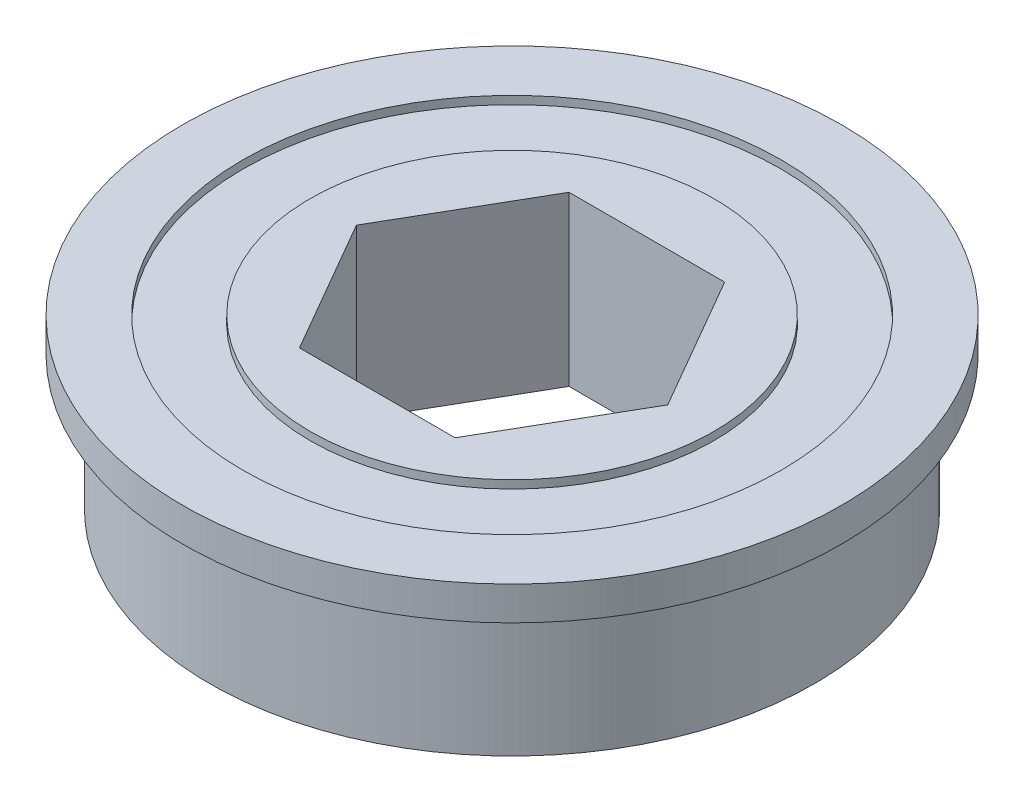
ISO-10303-21;
HEADER;
FILE_DESCRIPTION(('STEP AP214'),'2;1');
FILE_NAME('part.step','',(''),(''),'','','');
FILE_SCHEMA(('AUTOMOTIVE_DESIGN { 1 0 10303 214 1 1 1 1 }'));
ENDSEC;
DATA;
#1=APPLICATION_CONTEXT('core data for automotive mechanical design processes');
#2=APPLICATION_PROTOCOL_DEFINITION('international standard','automotive_design',2000,#1);
#3=PRODUCT_CONTEXT('',#1,'mechanical');
#4=PRODUCT('Part','Part','',(#3));
#5=PRODUCT_RELATED_PRODUCT_CATEGORY('part','',(#4));
#6=PRODUCT_DEFINITION_FORMATION('','',#4);
#7=PRODUCT_DEFINITION_CONTEXT('part definition',#1,'design');
#8=PRODUCT_DEFINITION('design','',#6,#7);
#9=PRODUCT_DEFINITION_SHAPE('','',#8);
#10=(LENGTH_UNIT() NAMED_UNIT(*) SI_UNIT(.MILLI.,.METRE.));
#11=(NAMED_UNIT(*) PLANE_ANGLE_UNIT() SI_UNIT($,.RADIAN.));
#12=(NAMED_UNIT(*) SI_UNIT($,.STERADIAN.) SOLID_ANGLE_UNIT());
#13=UNCERTAINTY_MEASURE_WITH_UNIT(LENGTH_MEASURE(1.E-05),#10,'distance_accuracy_value','');
#14=(GEOMETRIC_REPRESENTATION_CONTEXT(3) GLOBAL_UNCERTAINTY_ASSIGNED_CONTEXT((#13)) GLOBAL_UNIT_ASSIGNED_CONTEXT((#10,
#11,#12)) REPRESENTATION_CONTEXT('',''));
#15=CARTESIAN_POINT('',(0.,0.,0.));
#16=DIRECTION('',(0.,0.,1.));
#17=DIRECTION('',(1.,0.,0.));
#18=AXIS2_PLACEMENT_3D('',#15,#16,#17);
#19=CARTESIAN_POINT('',(0.,-7.5565,0.));
#20=DIRECTION('',(0.,-1.,0.));
#21=DIRECTION('',(0.,0.,-1.));
#22=AXIS2_PLACEMENT_3D('',#19,#20,#21);
#23=PLANE('',#22);
#24=CARTESIAN_POINT('',(0.,-7.5565,0.));
#25=DIRECTION('',(0.,1.,0.));
#26=DIRECTION('',(0.,0.,1.));
#27=AXIS2_PLACEMENT_3D('',#24,#25,#26);
#28=CIRCLE('',#27,12.7);
#29=CARTESIAN_POINT('',(0.,-7.5565,12.7));
#30=VERTEX_POINT('',#29);
#31=EDGE_CURVE('E11',#30,#30,#28,.T.);
#32=ORIENTED_EDGE('',*,*,#31,.F.);
#33=EDGE_LOOP('',(#32));
#34=FACE_BOUND('',#33,.T.);
#35=CARTESIAN_POINT('',(0.,-7.5565,0.));
#36=DIRECTION('',(0.,1.,0.));
#37=DIRECTION('',(0.,0.,1.));
#38=AXIS2_PLACEMENT_3D('',#35,#36,#37);
#39=CIRCLE('',#38,9.525);
#40=CARTESIAN_POINT('',(0.,-7.5565,9.525));
#41=VERTEX_POINT('',#40);
#42=EDGE_CURVE('E26',#41,#41,#39,.T.);
#43=ORIENTED_EDGE('',*,*,#42,.T.);
#44=EDGE_LOOP('',(#43));
#45=FACE_BOUND('',#44,.T.);
#46=ADVANCED_FACE('F17',(#34,#45),#23,.T.);
#47=CARTESIAN_POINT('',(0.,-7.5565,0.));
#48=DIRECTION('',(0.,-1.,0.));
#49=DIRECTION('',(0.,0.,-1.));
#50=AXIS2_PLACEMENT_3D('',#47,#48,#49);
#51=CYLINDRICAL_SURFACE('',#50,12.7);
#52=CARTESIAN_POINT('',(0.,-7.9375,0.));
#53=DIRECTION('',(0.,1.,0.));
#54=DIRECTION('',(0.,0.,1.));
#55=AXIS2_PLACEMENT_3D('',#52,#53,#54);
#56=CIRCLE('',#55,12.7);
#57=CARTESIAN_POINT('',(0.,-7.9375,12.7));
#58=VERTEX_POINT('',#57);
#59=EDGE_CURVE('E184',#58,#58,#56,.T.);
#60=ORIENTED_EDGE('',*,*,#59,.F.);
#61=EDGE_LOOP('',(#60));
#62=FACE_BOUND('',#61,.T.);
#63=ORIENTED_EDGE('',*,*,#31,.T.);
#64=EDGE_LOOP('',(#63));
#65=FACE_BOUND('',#64,.T.);
#66=ADVANCED_FACE('F19',(#62,#65),#51,.F.);
#67=CARTESIAN_POINT('',(0.,-7.5565,0.));
#68=DIRECTION('',(0.,-1.,0.));
#69=DIRECTION('',(0.,0.,-1.));
#70=AXIS2_PLACEMENT_3D('',#67,#68,#69);
#71=CYLINDRICAL_SURFACE('',#70,9.525);
#72=CARTESIAN_POINT('',(0.,-7.9375,0.));
#73=DIRECTION('',(0.,1.,0.));
#74=DIRECTION('',(0.,0.,1.));
#75=AXIS2_PLACEMENT_3D('',#72,#73,#74);
#76=CIRCLE('',#75,9.525);
#77=CARTESIAN_POINT('',(0.,-7.9375,9.525));
#78=VERTEX_POINT('',#77);
#79=EDGE_CURVE('E164',#78,#78,#76,.T.);
#80=ORIENTED_EDGE('',*,*,#79,.T.);
#81=EDGE_LOOP('',(#80));
#82=FACE_BOUND('',#81,.T.);
#83=ORIENTED_EDGE('',*,*,#42,.F.);
#84=EDGE_LOOP('',(#83));
#85=FACE_BOUND('',#84,.T.);
#86=ADVANCED_FACE('F278',(#82,#85),#71,.T.);
#87=CARTESIAN_POINT('',(0.,-0.381,0.));
#88=DIRECTION('',(0.,1.,0.));
#89=DIRECTION('',(1.,0.,0.));
#90=AXIS2_PLACEMENT_3D('',#87,#88,#89);
#91=PLANE('',#90);
#92=CARTESIAN_POINT('',(0.,-0.381,0.));
#93=DIRECTION('',(0.,1.,0.));
#94=DIRECTION('',(0.,0.,1.));
#95=AXIS2_PLACEMENT_3D('',#92,#93,#94);
#96=CIRCLE('',#95,12.7);
#97=CARTESIAN_POINT('',(0.,-0.381,12.7));
#98=VERTEX_POINT('',#97);
#99=EDGE_CURVE('E246',#98,#98,#96,.T.);
#100=ORIENTED_EDGE('',*,*,#99,.T.);
#101=EDGE_LOOP('',(#100));
#102=FACE_BOUND('',#101,.T.);
#103=CARTESIAN_POINT('',(0.,-0.381,0.));
#104=DIRECTION('',(0.,1.,0.));
#105=DIRECTION('',(0.,0.,1.));
#106=AXIS2_PLACEMENT_3D('',#103,#104,#105);
#107=CIRCLE('',#106,9.525);
#108=CARTESIAN_POINT('',(0.,-0.381,9.525));
#109=VERTEX_POINT('',#108);
#110=EDGE_CURVE('E213',#109,#109,#107,.T.);
#111=ORIENTED_EDGE('',*,*,#110,.F.);
#112=EDGE_LOOP('',(#111));
#113=FACE_BOUND('',#112,.T.);
#114=ADVANCED_FACE('F282',(#102,#113),#91,.T.);
#115=CARTESIAN_POINT('',(0.,-0.381,0.));
#116=DIRECTION('',(0.,1.,0.));
#117=DIRECTION('',(0.,0.,1.));
#118=AXIS2_PLACEMENT_3D('',#115,#116,#117);
#119=CYLINDRICAL_SURFACE('',#118,12.7);
#120=CARTESIAN_POINT('',(0.,0.,0.));
#121=DIRECTION('',(0.,1.,0.));
#122=DIRECTION('',(0.,0.,1.));
#123=AXIS2_PLACEMENT_3D('',#120,#121,#122);
#124=CIRCLE('',#123,12.7);
#125=CARTESIAN_POINT('',(0.,0.,12.7));
#126=VERTEX_POINT('',#125);
#127=EDGE_CURVE('E229',#126,#126,#124,.T.);
#128=ORIENTED_EDGE('',*,*,#127,.T.);
#129=EDGE_LOOP('',(#128));
#130=FACE_BOUND('',#129,.T.);
#131=ORIENTED_EDGE('',*,*,#99,.F.);
#132=EDGE_LOOP('',(#131));
#133=FACE_BOUND('',#132,.T.);
#134=ADVANCED_FACE('F396',(#130,#133),#119,.F.);
#135=CARTESIAN_POINT('',(0.,-0.381,0.));
#136=DIRECTION('',(0.,1.,0.));
#137=DIRECTION('',(0.,0.,1.));
#138=AXIS2_PLACEMENT_3D('',#135,#136,#137);
#139=CYLINDRICAL_SURFACE('',#138,9.525);
#140=CARTESIAN_POINT('',(0.,0.,0.));
#141=DIRECTION('',(0.,1.,0.));
#142=DIRECTION('',(0.,0.,1.));
#143=AXIS2_PLACEMENT_3D('',#140,#141,#142);
#144=CIRCLE('',#143,9.525);
#145=CARTESIAN_POINT('',(0.,0.,9.525));
#146=VERTEX_POINT('',#145);
#147=EDGE_CURVE('E188',#146,#146,#144,.T.);
#148=ORIENTED_EDGE('',*,*,#147,.F.);
#149=EDGE_LOOP('',(#148));
#150=FACE_BOUND('',#149,.T.);
#151=ORIENTED_EDGE('',*,*,#110,.T.);
#152=EDGE_LOOP('',(#151));
#153=FACE_BOUND('',#152,.T.);
#154=ADVANCED_FACE('F367',(#150,#153),#139,.T.);
#155=CARTESIAN_POINT('',(0.,-1.8415,0.));
#156=DIRECTION('',(0.,-1.,0.));
#157=DIRECTION('',(0.,0.,-1.));
#158=AXIS2_PLACEMENT_3D('',#155,#156,#157);
#159=TOROIDAL_SURFACE('',#158,14.2748,0.254);
#160=CARTESIAN_POINT('',(0.,-1.9685,0.));
#161=DIRECTION('',(0.,-1.,0.));
#162=DIRECTION('',(0.,0.,-1.));
#163=AXIS2_PLACEMENT_3D('',#160,#161,#162);
#164=CIRCLE('',#163,14.0548295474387);
#165=CARTESIAN_POINT('',(0.,-1.9685,-14.0548295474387));
#166=VERTEX_POINT('',#165);
#167=EDGE_CURVE('E182',#166,#166,#164,.T.);
#168=ORIENTED_EDGE('',*,*,#167,.F.);
#169=EDGE_LOOP('',(#168));
#170=FACE_BOUND('',#169,.T.);
#171=CARTESIAN_POINT('',(0.,-1.5875,0.));
#172=DIRECTION('',(0.,-1.,0.));
#173=DIRECTION('',(0.,0.,-1.));
#174=AXIS2_PLACEMENT_3D('',#171,#172,#173);
#175=CIRCLE('',#174,14.2748);
#176=CARTESIAN_POINT('',(0.,-1.5875,-14.2748));
#177=VERTEX_POINT('',#176);
#178=EDGE_CURVE('E204',#177,#177,#175,.T.);
#179=ORIENTED_EDGE('',*,*,#178,.T.);
#180=EDGE_LOOP('',(#179));
#181=FACE_BOUND('',#180,.T.);
#182=ADVANCED_FACE('F362',(#170,#181),#159,.F.);
#183=CARTESIAN_POINT('',(0.,-1.9685,0.));
#184=DIRECTION('',(0.,-1.,0.));
#185=DIRECTION('',(0.,0.,-1.));
#186=AXIS2_PLACEMENT_3D('',#183,#184,#185);
#187=CONICAL_SURFACE('',#186,14.0548295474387,0.523598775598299);
#188=ORIENTED_EDGE('',*,*,#167,.T.);
#189=EDGE_LOOP('',(#188));
#190=FACE_BOUND('',#189,.T.);
#191=CARTESIAN_POINT('',(0.,-2.3495,0.));
#192=DIRECTION('',(0.,-1.,0.));
#193=DIRECTION('',(0.,0.,-1.));
#194=AXIS2_PLACEMENT_3D('',#191,#192,#193);
#195=CIRCLE('',#194,14.2748);
#196=CARTESIAN_POINT('',(0.,-2.3495,-14.2748));
#197=VERTEX_POINT('',#196);
#198=EDGE_CURVE('E235',#197,#197,#195,.T.);
#199=ORIENTED_EDGE('',*,*,#198,.F.);
#200=EDGE_LOOP('',(#199));
#201=FACE_BOUND('',#200,.T.);
#202=ADVANCED_FACE('F366',(#190,#201),#187,.T.);
#203=CARTESIAN_POINT('',(-5.51025983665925,-44.7234247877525,-3.18135));
#204=DIRECTION('',(0.866025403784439,0.,0.5));
#205=DIRECTION('',(0.,-1.,0.));
#206=AXIS2_PLACEMENT_3D('',#203,#204,#205);
#207=PLANE('',#206);
#208=DIRECTION('',(0.,1.,0.));
#209=VECTOR('',#208,1.);
#210=CARTESIAN_POINT('',(-3.67350655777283,-44.7234247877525,-6.3627));
#211=LINE('',#210,#209);
#212=CARTESIAN_POINT('',(-3.67350655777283,-7.9375,-6.3627));
#213=VERTEX_POINT('',#212);
#214=CARTESIAN_POINT('',(-3.67350655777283,0.,-6.3627));
#215=VERTEX_POINT('',#214);
#216=EDGE_CURVE('E153',#213,#215,#211,.T.);
#217=ORIENTED_EDGE('',*,*,#216,.T.);
#218=DIRECTION('',(0.5,0.,-0.866025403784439));
#219=VECTOR('',#218,1.);
#220=CARTESIAN_POINT('',(-5.51025983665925,0.,-3.18135));
#221=LINE('',#220,#219);
#222=CARTESIAN_POINT('',(-7.34701311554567,0.,0.));
#223=VERTEX_POINT('',#222);
#224=EDGE_CURVE('E221',#223,#215,#221,.T.);
#225=ORIENTED_EDGE('',*,*,#224,.F.);
#226=DIRECTION('',(0.,1.,0.));
#227=VECTOR('',#226,1.);
#228=CARTESIAN_POINT('',(-7.34701311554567,-44.7234247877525,0.));
#229=LINE('',#228,#227);
#230=CARTESIAN_POINT('',(-7.34701311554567,-7.9375,0.));
#231=VERTEX_POINT('',#230);
#232=EDGE_CURVE('E179',#231,#223,#229,.T.);
#233=ORIENTED_EDGE('',*,*,#232,.F.);
#234=DIRECTION('',(-0.5,0.,0.866025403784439));
#235=VECTOR('',#234,1.);
#236=CARTESIAN_POINT('',(-5.51025983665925,-7.9375,-3.18135));
#237=LINE('',#236,#235);
#238=EDGE_CURVE('E175',#213,#231,#237,.T.);
#239=ORIENTED_EDGE('',*,*,#238,.F.);
#240=EDGE_LOOP('',(#217,#225,#233,#239));
#241=FACE_BOUND('',#240,.T.);
#242=ADVANCED_FACE('F338',(#241),#207,.T.);
#243=CARTESIAN_POINT('',(-5.51025983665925,-44.7234247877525,3.18135));
#244=DIRECTION('',(0.866025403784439,0.,-0.5));
#245=DIRECTION('',(0.,-1.,0.));
#246=AXIS2_PLACEMENT_3D('',#243,#244,#245);
#247=PLANE('',#246);
#248=ORIENTED_EDGE('',*,*,#232,.T.);
#249=DIRECTION('',(-0.5,0.,-0.866025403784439));
#250=VECTOR('',#249,1.);
#251=CARTESIAN_POINT('',(-5.51025983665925,0.,3.18135));
#252=LINE('',#251,#250);
#253=CARTESIAN_POINT('',(-3.67350655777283,0.,6.3627));
#254=VERTEX_POINT('',#253);
#255=EDGE_CURVE('E217',#254,#223,#252,.T.);
#256=ORIENTED_EDGE('',*,*,#255,.F.);
#257=DIRECTION('',(0.,1.,0.));
#258=VECTOR('',#257,1.);
#259=CARTESIAN_POINT('',(-3.67350655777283,-44.7234247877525,6.3627));
#260=LINE('',#259,#258);
#261=CARTESIAN_POINT('',(-3.67350655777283,-7.9375,6.3627));
#262=VERTEX_POINT('',#261);
#263=EDGE_CURVE('E183',#262,#254,#260,.T.);
#264=ORIENTED_EDGE('',*,*,#263,.F.);
#265=DIRECTION('',(0.5,0.,0.866025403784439));
#266=VECTOR('',#265,1.);
#267=CARTESIAN_POINT('',(-5.51025983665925,-7.9375,3.18135));
#268=LINE('',#267,#266);
#269=EDGE_CURVE('E192',#231,#262,#268,.T.);
#270=ORIENTED_EDGE('',*,*,#269,.F.);
#271=EDGE_LOOP('',(#248,#256,#264,#270));
#272=FACE_BOUND('',#271,.T.);
#273=ADVANCED_FACE('F333',(#272),#247,.T.);
#274=CARTESIAN_POINT('',(0.,-44.7234247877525,6.3627));
#275=DIRECTION('',(0.,0.,-1.));
#276=DIRECTION('',(-1.,0.,0.));
#277=AXIS2_PLACEMENT_3D('',#274,#275,#276);
#278=PLANE('',#277);
#279=ORIENTED_EDGE('',*,*,#263,.T.);
#280=DIRECTION('',(-1.,0.,0.));
#281=VECTOR('',#280,1.);
#282=CARTESIAN_POINT('',(0.,0.,6.3627));
#283=LINE('',#282,#281);
#284=CARTESIAN_POINT('',(3.67350655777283,0.,6.3627));
#285=VERTEX_POINT('',#284);
#286=EDGE_CURVE('E210',#285,#254,#283,.T.);
#287=ORIENTED_EDGE('',*,*,#286,.F.);
#288=DIRECTION('',(0.,1.,0.));
#289=VECTOR('',#288,1.);
#290=CARTESIAN_POINT('',(3.67350655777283,-44.7234247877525,6.3627));
#291=LINE('',#290,#289);
#292=CARTESIAN_POINT('',(3.67350655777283,-7.9375,6.3627));
#293=VERTEX_POINT('',#292);
#294=EDGE_CURVE('E152',#293,#285,#291,.T.);
#295=ORIENTED_EDGE('',*,*,#294,.F.);
#296=DIRECTION('',(1.,0.,0.));
#297=VECTOR('',#296,1.);
#298=CARTESIAN_POINT('',(0.,-7.9375,6.3627));
#299=LINE('',#298,#297);
#300=EDGE_CURVE('E162',#262,#293,#299,.T.);
#301=ORIENTED_EDGE('',*,*,#300,.F.);
#302=EDGE_LOOP('',(#279,#287,#295,#301));
#303=FACE_BOUND('',#302,.T.);
#304=ADVANCED_FACE('F337',(#303),#278,.T.);
#305=CARTESIAN_POINT('',(5.51025983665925,-44.7234247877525,3.18135));
#306=DIRECTION('',(-0.866025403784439,0.,-0.5));
#307=DIRECTION('',(-0.5,0.,0.866025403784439));
#308=AXIS2_PLACEMENT_3D('',#305,#306,#307);
#309=PLANE('',#308);
#310=ORIENTED_EDGE('',*,*,#294,.T.);
#311=DIRECTION('',(-0.5,0.,0.866025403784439));
#312=VECTOR('',#311,1.);
#313=CARTESIAN_POINT('',(5.51025983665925,0.,3.18135));
#314=LINE('',#313,#312);
#315=CARTESIAN_POINT('',(7.34701311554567,0.,0.));
#316=VERTEX_POINT('',#315);
#317=EDGE_CURVE('E146',#316,#285,#314,.T.);
#318=ORIENTED_EDGE('',*,*,#317,.F.);
#319=DIRECTION('',(0.,1.,0.));
#320=VECTOR('',#319,1.);
#321=CARTESIAN_POINT('',(7.34701311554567,-44.7234247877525,0.));
#322=LINE('',#321,#320);
#323=CARTESIAN_POINT('',(7.34701311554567,-7.9375,0.));
#324=VERTEX_POINT('',#323);
#325=EDGE_CURVE('E140',#324,#316,#322,.T.);
#326=ORIENTED_EDGE('',*,*,#325,.F.);
#327=DIRECTION('',(0.5,0.,-0.866025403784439));
#328=VECTOR('',#327,1.);
#329=CARTESIAN_POINT('',(5.51025983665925,-7.9375,3.18135));
#330=LINE('',#329,#328);
#331=EDGE_CURVE('E143',#293,#324,#330,.T.);
#332=ORIENTED_EDGE('',*,*,#331,.F.);
#333=EDGE_LOOP('',(#310,#318,#326,#332));
#334=FACE_BOUND('',#333,.T.);
#335=ADVANCED_FACE('F142',(#334),#309,.T.);
#336=CARTESIAN_POINT('',(5.51025983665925,-44.7234247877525,-3.18135));
#337=DIRECTION('',(-0.866025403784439,0.,0.5));
#338=DIRECTION('',(0.,1.,0.));
#339=AXIS2_PLACEMENT_3D('',#336,#337,#338);
#340=PLANE('',#339);
#341=ORIENTED_EDGE('',*,*,#325,.T.);
#342=DIRECTION('',(0.5,0.,0.866025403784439));
#343=VECTOR('',#342,1.);
#344=CARTESIAN_POINT('',(5.51025983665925,0.,-3.18135));
#345=LINE('',#344,#343);
#346=CARTESIAN_POINT('',(3.67350655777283,0.,-6.3627));
#347=VERTEX_POINT('',#346);
#348=EDGE_CURVE('E195',#347,#316,#345,.T.);
#349=ORIENTED_EDGE('',*,*,#348,.F.);
#350=DIRECTION('',(0.,1.,0.));
#351=VECTOR('',#350,1.);
#352=CARTESIAN_POINT('',(3.67350655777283,-44.7234247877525,-6.3627));
#353=LINE('',#352,#351);
#354=CARTESIAN_POINT('',(3.67350655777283,-7.9375,-6.3627));
#355=VERTEX_POINT('',#354);
#356=EDGE_CURVE('E167',#355,#347,#353,.T.);
#357=ORIENTED_EDGE('',*,*,#356,.F.);
#358=DIRECTION('',(-0.5,0.,-0.866025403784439));
#359=VECTOR('',#358,1.);
#360=CARTESIAN_POINT('',(5.51025983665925,-7.9375,-3.18135));
#361=LINE('',#360,#359);
#362=EDGE_CURVE('E159',#324,#355,#361,.T.);
#363=ORIENTED_EDGE('',*,*,#362,.F.);
#364=EDGE_LOOP('',(#341,#349,#357,#363));
#365=FACE_BOUND('',#364,.T.);
#366=ADVANCED_FACE('F166',(#365),#340,.T.);
#367=CARTESIAN_POINT('',(0.,-44.7234247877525,-6.3627));
#368=DIRECTION('',(0.,0.,1.));
#369=DIRECTION('',(1.,0.,0.));
#370=AXIS2_PLACEMENT_3D('',#367,#368,#369);
#371=PLANE('',#370);
#372=ORIENTED_EDGE('',*,*,#356,.T.);
#373=DIRECTION('',(1.,0.,0.));
#374=VECTOR('',#373,1.);
#375=CARTESIAN_POINT('',(0.,0.,-6.3627));
#376=LINE('',#375,#374);
#377=EDGE_CURVE('E198',#215,#347,#376,.T.);
#378=ORIENTED_EDGE('',*,*,#377,.F.);
#379=ORIENTED_EDGE('',*,*,#216,.F.);
#380=DIRECTION('',(-1.,0.,0.));
#381=VECTOR('',#380,1.);
#382=CARTESIAN_POINT('',(0.,-7.9375,-6.3627));
#383=LINE('',#382,#381);
#384=EDGE_CURVE('E170',#355,#213,#383,.T.);
#385=ORIENTED_EDGE('',*,*,#384,.F.);
#386=EDGE_LOOP('',(#372,#378,#379,#385));
#387=FACE_BOUND('',#386,.T.);
#388=ADVANCED_FACE('F306',(#387),#371,.T.);
#389=CARTESIAN_POINT('',(0.,-1.5875,0.));
#390=DIRECTION('',(0.,-1.,0.));
#391=DIRECTION('',(0.,0.,-1.));
#392=AXIS2_PLACEMENT_3D('',#389,#390,#391);
#393=PLANE('',#392);
#394=CARTESIAN_POINT('',(0.,-1.5875,0.));
#395=DIRECTION('',(0.,-1.,0.));
#396=DIRECTION('',(0.,0.,-1.));
#397=AXIS2_PLACEMENT_3D('',#394,#395,#396);
#398=CIRCLE('',#397,15.5575);
#399=CARTESIAN_POINT('',(0.,-1.5875,-15.5575));
#400=VERTEX_POINT('',#399);
#401=EDGE_CURVE('E207',#400,#400,#398,.T.);
#402=ORIENTED_EDGE('',*,*,#401,.T.);
#403=EDGE_LOOP('',(#402));
#404=FACE_BOUND('',#403,.T.);
#405=ORIENTED_EDGE('',*,*,#178,.F.);
#406=EDGE_LOOP('',(#405));
#407=FACE_BOUND('',#406,.T.);
#408=ADVANCED_FACE('F265',(#404,#407),#393,.T.);
#409=CARTESIAN_POINT('',(0.,-1.5875,0.));
#410=DIRECTION('',(0.,1.,0.));
#411=DIRECTION('',(0.,0.,1.));
#412=AXIS2_PLACEMENT_3D('',#409,#410,#411);
#413=CYLINDRICAL_SURFACE('',#412,15.5575);
#414=CARTESIAN_POINT('',(0.,0.,0.));
#415=DIRECTION('',(0.,-1.,0.));
#416=DIRECTION('',(0.,0.,-1.));
#417=AXIS2_PLACEMENT_3D('',#414,#415,#416);
#418=CIRCLE('',#417,15.5575);
#419=CARTESIAN_POINT('',(0.,0.,-15.5575));
#420=VERTEX_POINT('',#419);
#421=EDGE_CURVE('E232',#420,#420,#418,.T.);
#422=ORIENTED_EDGE('',*,*,#421,.T.);
#423=EDGE_LOOP('',(#422));
#424=FACE_BOUND('',#423,.T.);
#425=ORIENTED_EDGE('',*,*,#401,.F.);
#426=EDGE_LOOP('',(#425));
#427=FACE_BOUND('',#426,.T.);
#428=ADVANCED_FACE('F259',(#424,#427),#413,.T.);
#429=CARTESIAN_POINT('',(0.,-7.9375,0.));
#430=DIRECTION('',(0.,1.,0.));
#431=DIRECTION('',(0.,0.,1.));
#432=AXIS2_PLACEMENT_3D('',#429,#430,#431);
#433=CYLINDRICAL_SURFACE('',#432,14.2748);
#434=CARTESIAN_POINT('',(0.,-7.9375,0.));
#435=DIRECTION('',(0.,-1.,0.));
#436=DIRECTION('',(0.,0.,-1.));
#437=AXIS2_PLACEMENT_3D('',#434,#435,#436);
#438=CIRCLE('',#437,14.2748);
#439=CARTESIAN_POINT('',(0.,-7.9375,-14.2748));
#440=VERTEX_POINT('',#439);
#441=EDGE_CURVE('E187',#440,#440,#438,.T.);
#442=ORIENTED_EDGE('',*,*,#441,.F.);
#443=EDGE_LOOP('',(#442));
#444=FACE_BOUND('',#443,.T.);
#445=ORIENTED_EDGE('',*,*,#198,.T.);
#446=EDGE_LOOP('',(#445));
#447=FACE_BOUND('',#446,.T.);
#448=ADVANCED_FACE('F264',(#444,#447),#433,.T.);
#449=CARTESIAN_POINT('',(0.,0.,0.));
#450=DIRECTION('',(0.,-1.,0.));
#451=DIRECTION('',(0.,0.,-1.));
#452=AXIS2_PLACEMENT_3D('',#449,#450,#451);
#453=PLANE('',#452);
#454=ORIENTED_EDGE('',*,*,#421,.F.);
#455=EDGE_LOOP('',(#454));
#456=FACE_BOUND('',#455,.T.);
#457=ORIENTED_EDGE('',*,*,#127,.F.);
#458=EDGE_LOOP('',(#457));
#459=FACE_BOUND('',#458,.T.);
#460=ADVANCED_FACE('F314',(#456,#459),#453,.F.);
#461=CARTESIAN_POINT('',(0.,-7.9375,0.));
#462=DIRECTION('',(0.,-1.,0.));
#463=DIRECTION('',(0.,0.,-1.));
#464=AXIS2_PLACEMENT_3D('',#461,#462,#463);
#465=PLANE('',#464);
#466=ORIENTED_EDGE('',*,*,#441,.T.);
#467=EDGE_LOOP('',(#466));
#468=FACE_BOUND('',#467,.T.);
#469=ORIENTED_EDGE('',*,*,#59,.T.);
#470=EDGE_LOOP('',(#469));
#471=FACE_BOUND('',#470,.T.);
#472=ADVANCED_FACE('F298',(#468,#471),#465,.T.);
#473=CARTESIAN_POINT('',(0.,0.,0.));
#474=DIRECTION('',(0.,-1.,0.));
#475=DIRECTION('',(0.,0.,-1.));
#476=AXIS2_PLACEMENT_3D('',#473,#474,#475);
#477=PLANE('',#476);
#478=ORIENTED_EDGE('',*,*,#147,.T.);
#479=EDGE_LOOP('',(#478));
#480=FACE_BOUND('',#479,.T.);
#481=ORIENTED_EDGE('',*,*,#377,.T.);
#482=ORIENTED_EDGE('',*,*,#348,.T.);
#483=ORIENTED_EDGE('',*,*,#317,.T.);
#484=ORIENTED_EDGE('',*,*,#286,.T.);
#485=ORIENTED_EDGE('',*,*,#255,.T.);
#486=ORIENTED_EDGE('',*,*,#224,.T.);
#487=EDGE_LOOP('',(#481,#482,#483,#484,#485,#486));
#488=FACE_BOUND('',#487,.T.);
#489=ADVANCED_FACE('F290',(#480,#488),#477,.F.);
#490=CARTESIAN_POINT('',(0.,-7.9375,0.));
#491=DIRECTION('',(0.,-1.,0.));
#492=DIRECTION('',(0.,0.,-1.));
#493=AXIS2_PLACEMENT_3D('',#490,#491,#492);
#494=PLANE('',#493);
#495=ORIENTED_EDGE('',*,*,#79,.F.);
#496=EDGE_LOOP('',(#495));
#497=FACE_BOUND('',#496,.T.);
#498=ORIENTED_EDGE('',*,*,#362,.T.);
#499=ORIENTED_EDGE('',*,*,#384,.T.);
#500=ORIENTED_EDGE('',*,*,#238,.T.);
#501=ORIENTED_EDGE('',*,*,#269,.T.);
#502=ORIENTED_EDGE('',*,*,#300,.T.);
#503=ORIENTED_EDGE('',*,*,#331,.T.);
#504=EDGE_LOOP('',(#498,#499,#500,#501,#502,#503));
#505=FACE_BOUND('',#504,.T.);
#506=ADVANCED_FACE('F157',(#497,#505),#494,.T.);
#507=CLOSED_SHELL('',(#46,#66,#86,#114,#134,#154,#182,#202,#242,#273,#304,#335,#366,#388,#408,
#428,#448,#460,#472,#489,#506));
#508=MANIFOLD_SOLID_BREP('B1',#507);
#509=ADVANCED_BREP_SHAPE_REPRESENTATION('',(#18,#508),#14);
#510=SHAPE_DEFINITION_REPRESENTATION(#9,#509);
ENDSEC;
END-ISO-10303-21;
